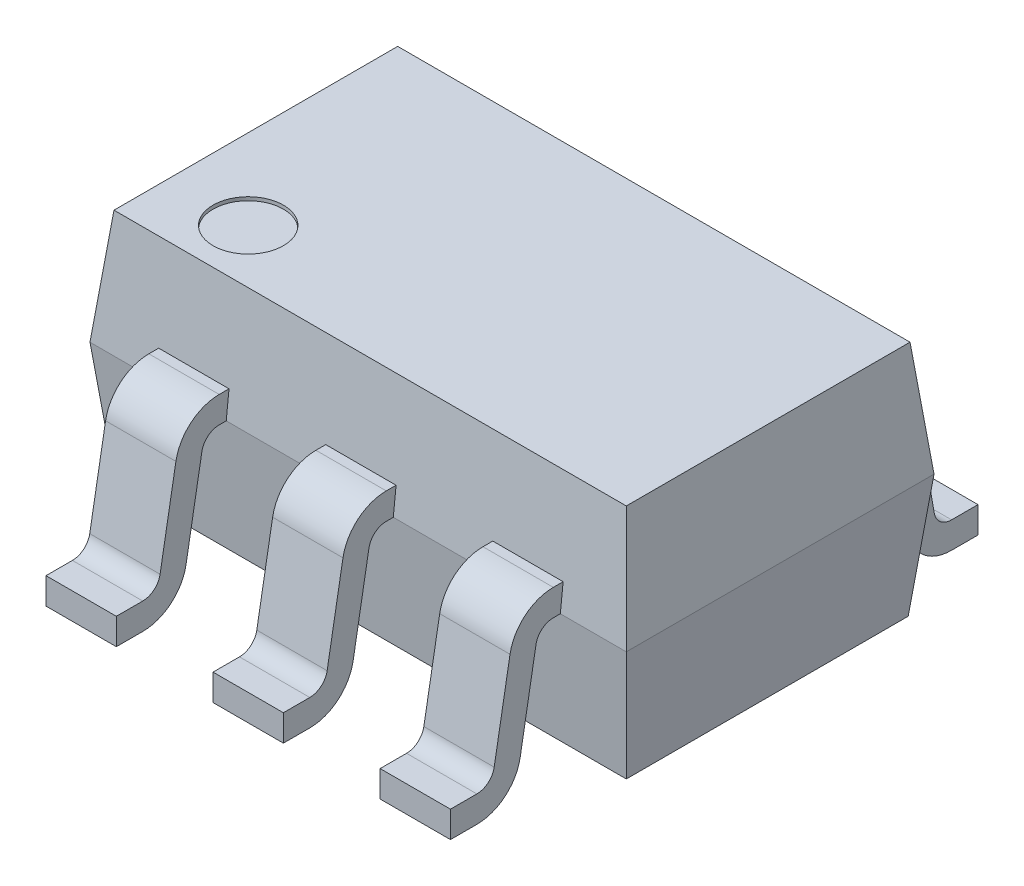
from build123d import *

# Parameters (mm, degrees)
EXTRUDE_START              = 0.8
SKETCH_3_W                 = 3.05
SKETCH_3_H                 = 1.75
EXTRUDE_2_DEPTH            = 0.65
EXTRUDE_2_TAPER            = 6
EXTRUDE_2_OTHER_WAY_DEPTH  = 0.7
EXTRUDE_2_OTHER_WAY_TAPER  = 6
EXTRUDE_START_2            = -0.2
EXTRUDE_1_DEPTH            = 0.4
PATTERN_LINEAR_1_COUNT     = 2
PATTERN_LINEAR_1_PITCH     = 0.95
PATTERN_LINEAR_1_COL_COUNT = 2
PATTERN_LINEAR_1_COL_PITCH = 0.95
SKETCH_4_R                 = 0.2
CUT_EXTRUDE_3_DEPTH        = 0.02


with BuildPart() as part:
    # Sketch 3 → Extrude 2 (new body)
    with BuildSketch(Plane(origin=(0, 0, 0), x_dir=(1, 0, 0), z_dir=(0, 1, 0)).offset(EXTRUDE_START)):
        Rectangle(SKETCH_3_W, SKETCH_3_H)
    extrude(amount=EXTRUDE_2_DEPTH, taper=EXTRUDE_2_TAPER)

    # Sketch 3 → Extrude 2 other way (add)
    with BuildSketch(Plane(origin=(0, 0, 0), x_dir=(1, 0, 0), z_dir=(0, 1, 0)).offset(EXTRUDE_START)):
        Rectangle(SKETCH_3_W, SKETCH_3_H)
    extrude(amount=-EXTRUDE_2_OTHER_WAY_DEPTH, taper=EXTRUDE_2_OTHER_WAY_TAPER)

    # Sketch 1 → Extrude 1 (add)
    with BuildSketch(Plane(origin=(0, 0, 0), x_dir=(0, 0, -1), z_dir=(1, 0, 0)).offset(EXTRUDE_START_2)):
        with BuildLine():
            Line((-1.5, 0), (-1.349774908, 0))
            ThreePointArc((-1.349774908, 0), (-1.189078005, 0.058488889), (-1.10357297, 0.206587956))
            Line((-1.10357297, 0.206587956), (-1.013509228, 0.717364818))
            ThreePointArc((-1.013509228, 0.717364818), (-0.979307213, 0.776604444), (-0.915028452, 0.8))
            Line((-0.915028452, 0.8), (0.915028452, 0.8))
            ThreePointArc((0.915028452, 0.8), (0.979307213, 0.776604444), (1.013509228, 0.717364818))
            Line((1.013509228, 0.717364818), (1.10357297, 0.206587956))
            ThreePointArc((1.10357297, 0.206587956), (1.189078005, 0.058488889), (1.349774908, 0))
            Line((1.349774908, 0), (1.5, 0))
            Line((1.5, 0), (1.5, 0.15))
            Line((1.5, 0.15), (1.349774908, 0.15))
            ThreePointArc((1.349774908, 0.15), (1.285496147, 0.173395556), (1.251294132, 0.232635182))
            Line((1.251294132, 0.232635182), (1.161230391, 0.743412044))
            ThreePointArc((1.161230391, 0.743412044), (1.075725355, 0.891511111), (0.915028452, 0.95))
            Line((0.915028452, 0.95), (-0.915028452, 0.95))
            ThreePointArc((-0.915028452, 0.95), (-1.075725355, 0.891511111), (-1.161230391, 0.743412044))
            Line((-1.161230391, 0.743412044), (-1.251294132, 0.232635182))
            ThreePointArc((-1.251294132, 0.232635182), (-1.285496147, 0.173395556), (-1.349774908, 0.15))
            Line((-1.349774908, 0.15), (-1.5, 0.15))
            Line((-1.5, 0.15), (-1.5, 0))
        make_face()
    extrude_1 = extrude(amount=EXTRUDE_1_DEPTH)

    # Pattern Linear 1: Extrude 1 ×2
    with Locations(*[(i * PATTERN_LINEAR_1_PITCH, 0, 0) for i in range(1, PATTERN_LINEAR_1_COUNT)]):
        add(extrude_1)

    # Pattern Linear 1 col: Extrude 1 ×2
    with Locations(*[(-i * PATTERN_LINEAR_1_COL_PITCH, 0, 0) for i in range(1, PATTERN_LINEAR_1_COL_COUNT)]):
        add(extrude_1)

    # Sketch 4 → Cut-Extrude 3 (cut)
    with BuildSketch(Plane(origin=(0, 1.45, 0), x_dir=(1, 0, 0), z_dir=(0, 1, 0))):
        with Locations(Location((-1, -0.5, 0), (0, 0, 270))):
            Circle(SKETCH_4_R)
    extrude(amount=-CUT_EXTRUDE_3_DEPTH, mode=Mode.SUBTRACT)


solid = part.part
